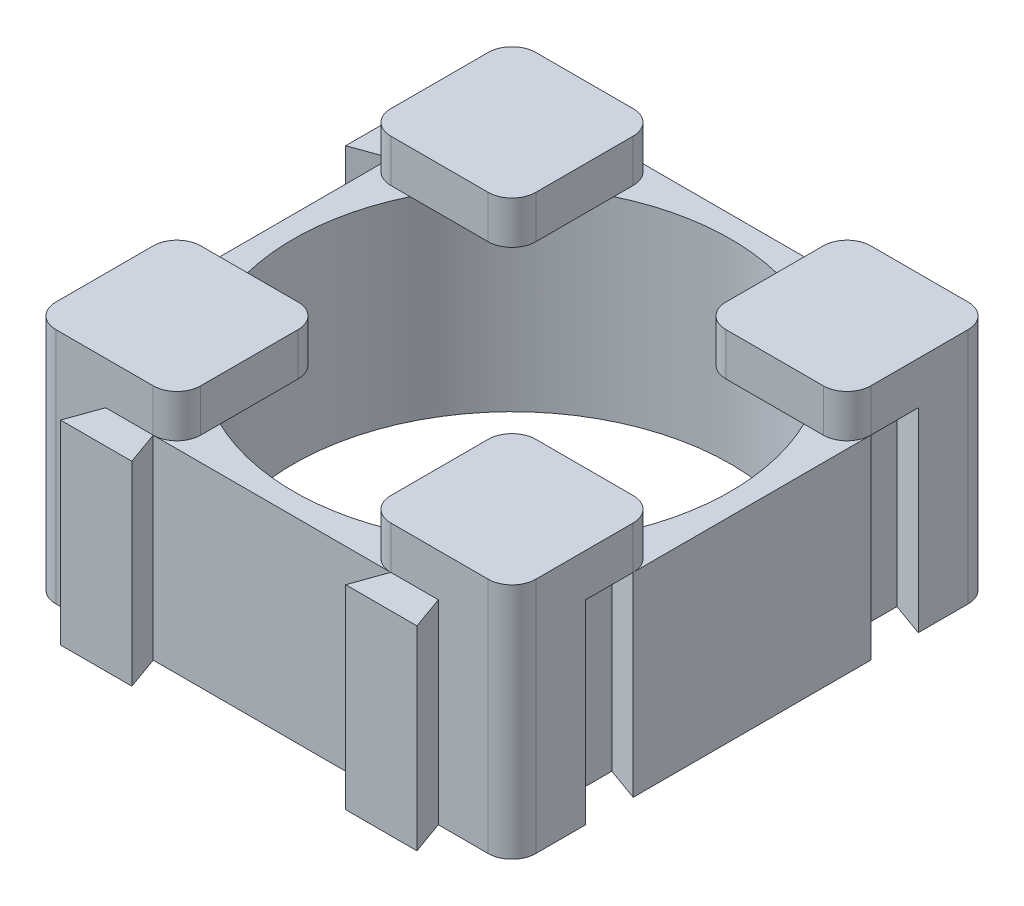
from build123d import *

# Parameters (mm, degrees)
SKETCH1_R           = 9.2
BOSS_EXTRUDE1_DEPTH = 8.2
BOSS_EXTRUDE2_DEPTH = 1.8


with BuildPart() as part:
    # Sketch1 → Boss-Extrude1 (new body)
    with BuildSketch(Plane(origin=(0, 0, 0), x_dir=(1, 0, 0), z_dir=(0, 1, 0))):
        with BuildLine():
            Line((-9.1, 10.1), (-7, 10.1))
            Line((-7, 10.1), (-7.5, 8.7))
            Line((-7.5, 8.7), (-4.5, 8.7))
            Line((-4.5, 8.7), (-5, 10.1))
            Line((-5, 10.1), (5, 10.1))
            Line((5, 10.1), (4.5, 8.7))
            Line((4.5, 8.7), (7.5, 8.7))
            Line((7.5, 8.7), (7, 10.1))
            Line((7, 10.1), (9.1, 10.1))
            ThreePointArc((9.1, 10.1), (9.807106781, 9.807106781), (10.1, 9.1))
            Line((10.1, 9.1), (10.1, 7))
            Line((10.1, 7), (8.7, 7.5))
            Line((8.7, 7.5), (8.7, 4.5))
            Line((8.7, 4.5), (10.1, 5))
            Line((10.1, 5), (10.1, -5))
            Line((10.1, -5), (8.7, -4.5))
            Line((8.7, -4.5), (8.7, -7.5))
            Line((8.7, -7.5), (10.1, -7))
            Line((10.1, -7), (10.1, -9.1))
            ThreePointArc((10.1, -9.1), (9.807106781, -9.807106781), (9.1, -10.1))
            Line((9.1, -10.1), (7, -10.1))
            Line((7, -10.1), (7.5, -11.5))
            Line((7.5, -11.5), (4.5, -11.5))
            Line((4.5, -11.5), (5, -10.1))
            Line((5, -10.1), (-5, -10.1))
            Line((-5, -10.1), (-4.5, -11.5))
            Line((-4.5, -11.5), (-7.5, -11.5))
            Line((-7.5, -11.5), (-7, -10.1))
            Line((-7, -10.1), (-9.1, -10.1))
            ThreePointArc((-9.1, -10.1), (-9.807106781, -9.807106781), (-10.1, -9.1))
            Line((-10.1, -9.1), (-10.1, -7))
            Line((-10.1, -7), (-11.5, -7.5))
            Line((-11.5, -7.5), (-11.5, -4.5))
            Line((-11.5, -4.5), (-10.1, -5))
            Line((-10.1, -5), (-10.1, 5))
            Line((-10.1, 5), (-11.5, 4.5))
            Line((-11.5, 4.5), (-11.5, 7.5))
            Line((-11.5, 7.5), (-10.1, 7))
            Line((-10.1, 7), (-10.1, 9.1))
            ThreePointArc((-10.1, 9.1), (-9.807106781, 9.807106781), (-9.1, 10.1))
        make_face()
        with Locations(Location((0, 0, 0), (0, 0, 270))):
            Circle(SKETCH1_R, mode=Mode.SUBTRACT)
    extrude(amount=BOSS_EXTRUDE1_DEPTH)

    # Sketch2 → Boss-Extrude2 (add)
    with BuildSketch(Plane(origin=(0, 8.2, 0), x_dir=(1, 0, 0), z_dir=(0, 1, 0))):
        with BuildLine():
            Line((-9.1, 4), (-5, 4))
            ThreePointArc((-5, 4), (-4.292893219, 4.292893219), (-4, 5))
            Line((-4, 5), (-4, 9.1))
            ThreePointArc((-4, 9.1), (-4.292893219, 9.807106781), (-5, 10.1))
            Line((-5, 10.1), (-9.1, 10.1))
            ThreePointArc((-9.1, 10.1), (-9.807106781, 9.807106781), (-10.1, 9.1))
            Line((-10.1, 9.1), (-10.1, 5))
            ThreePointArc((-10.1, 5), (-9.807106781, 4.292893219), (-9.1, 4))
        make_face()
        with BuildLine():
            Line((10.1, 9.1), (10.1, 5))
            ThreePointArc((10.1, 5), (9.807106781, 4.292893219), (9.1, 4))
            Line((9.1, 4), (5, 4))
            ThreePointArc((5, 4), (4.292893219, 4.292893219), (4, 5))
            Line((4, 5), (4, 9.1))
            ThreePointArc((4, 9.1), (4.292893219, 9.807106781), (5, 10.1))
            Line((5, 10.1), (9.1, 10.1))
            ThreePointArc((9.1, 10.1), (9.807106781, 9.807106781), (10.1, 9.1))
        make_face()
        with BuildLine():
            Line((9.1, -4), (5, -4))
            ThreePointArc((5, -4), (4.292893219, -4.292893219), (4, -5))
            Line((4, -5), (4, -9.1))
            ThreePointArc((4, -9.1), (4.292893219, -9.807106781), (5, -10.1))
            Line((5, -10.1), (9.1, -10.1))
            ThreePointArc((9.1, -10.1), (9.807106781, -9.807106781), (10.1, -9.1))
            Line((10.1, -9.1), (10.1, -5))
            ThreePointArc((10.1, -5), (9.807106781, -4.292893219), (9.1, -4))
        make_face()
        with BuildLine():
            Line((-4, -5), (-4, -9.1))
            ThreePointArc((-4, -9.1), (-4.292893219, -9.807106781), (-5, -10.1))
            Line((-5, -10.1), (-9.1, -10.1))
            ThreePointArc((-9.1, -10.1), (-9.807106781, -9.807106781), (-10.1, -9.1))
            Line((-10.1, -9.1), (-10.1, -5))
            ThreePointArc((-10.1, -5), (-9.807106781, -4.292893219), (-9.1, -4))
            Line((-9.1, -4), (-5, -4))
            ThreePointArc((-5, -4), (-4.292893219, -4.292893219), (-4, -5))
        make_face()
    extrude(amount=BOSS_EXTRUDE2_DEPTH)


solid = part.part
